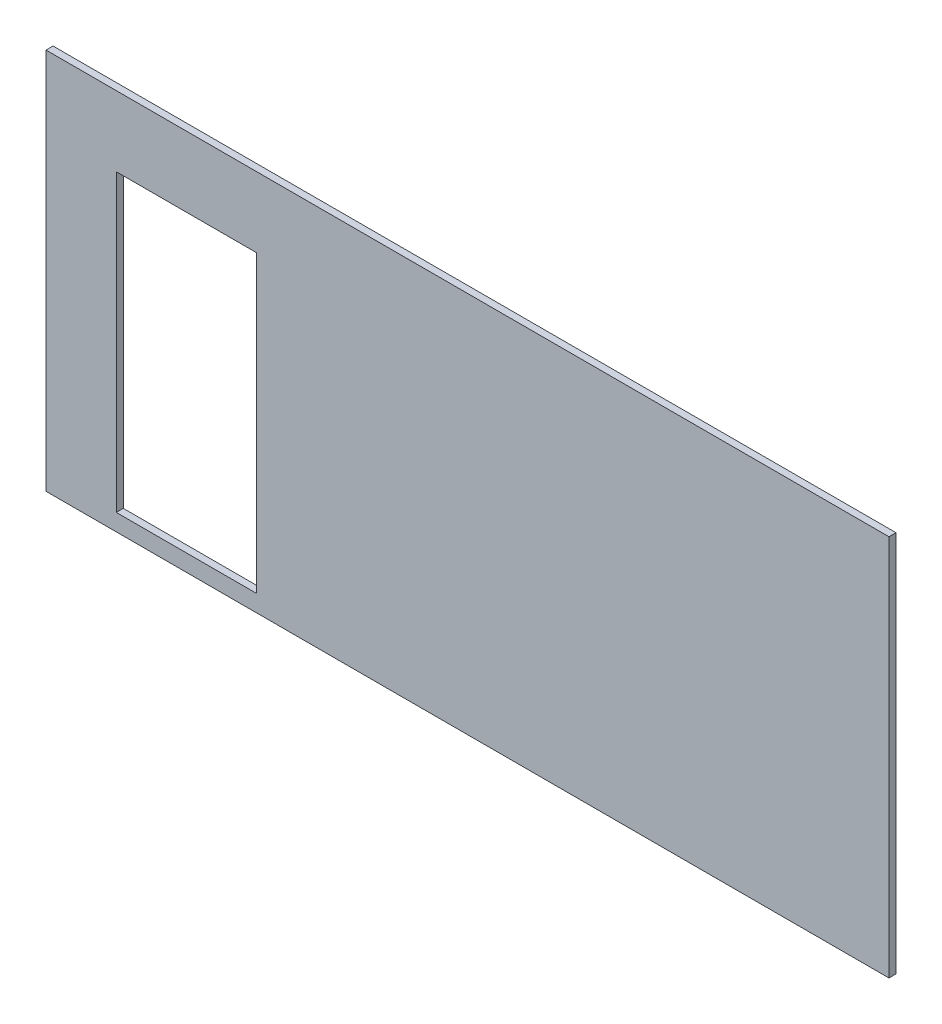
from build123d import *

# Parameters (mm, degrees)
ESQUISSE1_W      = 600
ESQUISSE1_H      = 272
ESQUISSE1_W_2    = 100
ESQUISSE1_H_2    = 210
EXTRUSION1_DEPTH = 5


with BuildPart() as part:
    # Esquisse1 → Extrusion1 (new body)
    with BuildSketch(Plane.XY):
        with Locations((271.489416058, 136)):
            Rectangle(ESQUISSE1_W, ESQUISSE1_H)
        with Locations((71.489416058, 117)):
            Rectangle(ESQUISSE1_W_2, ESQUISSE1_H_2, mode=Mode.SUBTRACT)
    extrude(amount=EXTRUSION1_DEPTH)


solid = part.part
